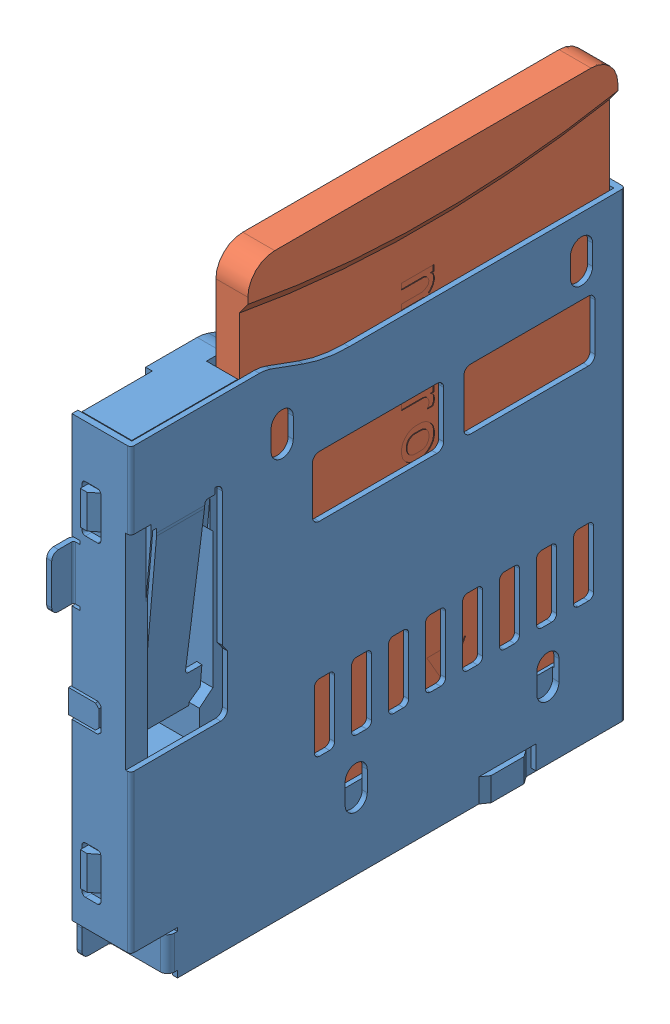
SolidWorks assembly Assem2.sldasm, configuration Default (file format 9000). Lengths in mm.
Overall size (2.44 17.9 16).
2 component instances, 2 part files, 0 mates.
Components (placement in the parent):
- CD card slot-2: CD card slot.sldprt [Default] at (-120.5536 47.0914 197.6703) x (0 0 1) z (1 0 0) size (16 15 2.44)
- Micro sd card-2: Micro sd card.sldprt [Default] at (-120.5536 45.5089 151.9853) x (0 0 1) z (1 0 0) size (11 15 0.95)
